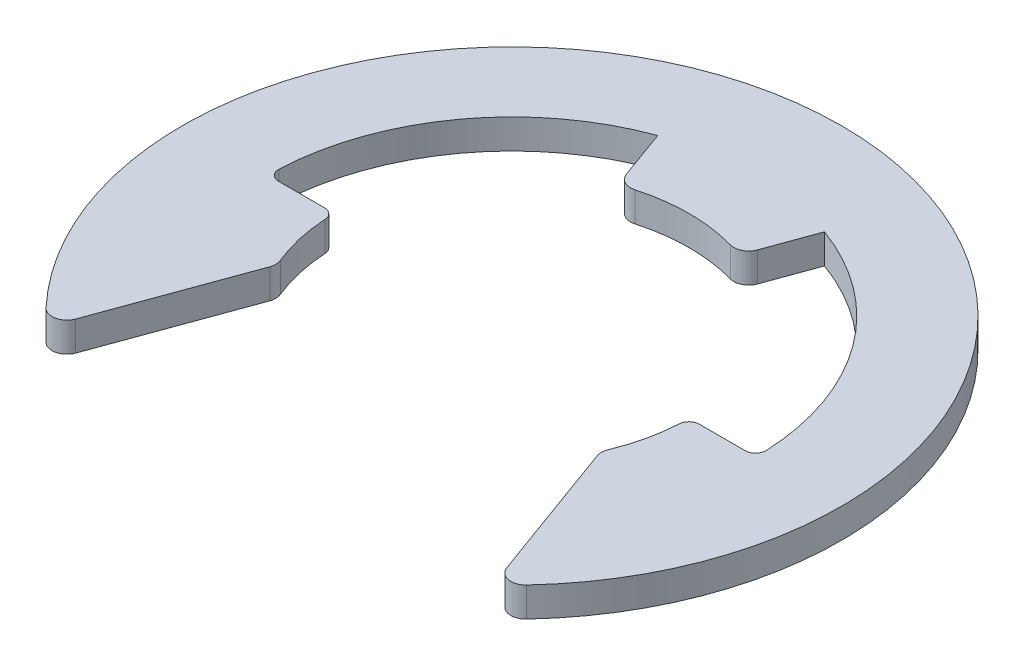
ISO-10303-21;
HEADER;
FILE_DESCRIPTION(('STEP AP214'),'2;1');
FILE_NAME('part.step','',(''),(''),'','','');
FILE_SCHEMA(('AUTOMOTIVE_DESIGN { 1 0 10303 214 1 1 1 1 }'));
ENDSEC;
DATA;
#1=APPLICATION_CONTEXT('core data for automotive mechanical design processes');
#2=APPLICATION_PROTOCOL_DEFINITION('international standard','automotive_design',2000,#1);
#3=PRODUCT_CONTEXT('',#1,'mechanical');
#4=PRODUCT('Part','Part','',(#3));
#5=PRODUCT_RELATED_PRODUCT_CATEGORY('part','',(#4));
#6=PRODUCT_DEFINITION_FORMATION('','',#4);
#7=PRODUCT_DEFINITION_CONTEXT('part definition',#1,'design');
#8=PRODUCT_DEFINITION('design','',#6,#7);
#9=PRODUCT_DEFINITION_SHAPE('','',#8);
#10=(LENGTH_UNIT() NAMED_UNIT(*) SI_UNIT(.MILLI.,.METRE.));
#11=(NAMED_UNIT(*) PLANE_ANGLE_UNIT() SI_UNIT($,.RADIAN.));
#12=(NAMED_UNIT(*) SI_UNIT($,.STERADIAN.) SOLID_ANGLE_UNIT());
#13=UNCERTAINTY_MEASURE_WITH_UNIT(LENGTH_MEASURE(1.E-05),#10,'distance_accuracy_value','');
#14=(GEOMETRIC_REPRESENTATION_CONTEXT(3) GLOBAL_UNCERTAINTY_ASSIGNED_CONTEXT((#13)) GLOBAL_UNIT_ASSIGNED_CONTEXT((#10,
#11,#12)) REPRESENTATION_CONTEXT('',''));
#15=CARTESIAN_POINT('',(0.,0.,0.));
#16=DIRECTION('',(0.,0.,1.));
#17=DIRECTION('',(1.,0.,0.));
#18=AXIS2_PLACEMENT_3D('',#15,#16,#17);
#19=CARTESIAN_POINT('',(0.,1.,0.));
#20=DIRECTION('',(0.,-1.,0.));
#21=DIRECTION('',(0.,0.,-1.));
#22=AXIS2_PLACEMENT_3D('',#19,#20,#21);
#23=CYLINDRICAL_SURFACE('',#22,16.5);
#24=CARTESIAN_POINT('',(0.,1.,0.));
#25=DIRECTION('',(0.,-1.,0.));
#26=DIRECTION('',(0.,0.,1.));
#27=AXIS2_PLACEMENT_3D('',#24,#25,#26);
#28=CIRCLE('',#27,16.5);
#29=CARTESIAN_POINT('',(-16.483798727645,1.,-0.731012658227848));
#30=VERTEX_POINT('',#29);
#31=CARTESIAN_POINT('',(-5.64333236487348,1.,-15.5049282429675));
#32=VERTEX_POINT('',#31);
#33=EDGE_CURVE('E187',#30,#32,#28,.T.);
#34=ORIENTED_EDGE('',*,*,#33,.F.);
#35=DIRECTION('',(0.,-1.,0.));
#36=VECTOR('',#35,1.);
#37=CARTESIAN_POINT('',(-16.483798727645,1.,-0.731012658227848));
#38=LINE('',#37,#36);
#39=CARTESIAN_POINT('',(-16.483798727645,-1.,-0.731012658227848));
#40=VERTEX_POINT('',#39);
#41=EDGE_CURVE('E328',#30,#40,#38,.T.);
#42=ORIENTED_EDGE('',*,*,#41,.T.);
#43=CARTESIAN_POINT('',(0.,-1.,0.));
#44=DIRECTION('',(0.,-1.,0.));
#45=DIRECTION('',(0.,0.,1.));
#46=AXIS2_PLACEMENT_3D('',#43,#44,#45);
#47=CIRCLE('',#46,16.5);
#48=CARTESIAN_POINT('',(-5.64333236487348,-1.,-15.5049282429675));
#49=VERTEX_POINT('',#48);
#50=EDGE_CURVE('E211',#40,#49,#47,.T.);
#51=ORIENTED_EDGE('',*,*,#50,.T.);
#52=DIRECTION('',(0.,-1.,0.));
#53=VECTOR('',#52,1.);
#54=CARTESIAN_POINT('',(-5.64333236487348,1.,-15.5049282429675));
#55=LINE('',#54,#53);
#56=EDGE_CURVE('E204',#32,#49,#55,.T.);
#57=ORIENTED_EDGE('',*,*,#56,.F.);
#58=EDGE_LOOP('',(#34,#42,#51,#57));
#59=FACE_BOUND('',#58,.T.);
#60=ADVANCED_FACE('F39',(#59),#23,.F.);
#61=CARTESIAN_POINT('',(-5.64333236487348,1.,-15.5049282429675));
#62=DIRECTION('',(0.93969262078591,0.,-0.342020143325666));
#63=DIRECTION('',(-0.342020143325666,0.,-0.93969262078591));
#64=AXIS2_PLACEMENT_3D('',#61,#62,#63);
#65=PLANE('',#64);
#66=DIRECTION('',(0.342020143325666,0.,0.93969262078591));
#67=VECTOR('',#66,1.);
#68=CARTESIAN_POINT('',(-5.64333236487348,-1.,-15.5049282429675));
#69=LINE('',#68,#67);
#70=CARTESIAN_POINT('',(-4.43308772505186,-1.,-12.1798084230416));
#71=VERTEX_POINT('',#70);
#72=EDGE_CURVE('E446',#49,#71,#69,.T.);
#73=ORIENTED_EDGE('',*,*,#72,.T.);
#74=DIRECTION('',(0.,-1.,0.));
#75=VECTOR('',#74,1.);
#76=CARTESIAN_POINT('',(-4.43308772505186,1.,-12.1798084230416));
#77=LINE('',#76,#75);
#78=CARTESIAN_POINT('',(-4.43308772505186,1.,-12.1798084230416));
#79=VERTEX_POINT('',#78);
#80=EDGE_CURVE('E206',#71,#79,#77,.F.);
#81=ORIENTED_EDGE('',*,*,#80,.T.);
#82=DIRECTION('',(0.342020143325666,0.,0.93969262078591));
#83=VECTOR('',#82,1.);
#84=CARTESIAN_POINT('',(-5.64333236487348,1.,-15.5049282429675));
#85=LINE('',#84,#83);
#86=EDGE_CURVE('E191',#32,#79,#85,.T.);
#87=ORIENTED_EDGE('',*,*,#86,.F.);
#88=ORIENTED_EDGE('',*,*,#56,.T.);
#89=EDGE_LOOP('',(#73,#81,#87,#88));
#90=FACE_BOUND('',#89,.T.);
#91=ADVANCED_FACE('F203',(#90),#65,.F.);
#92=CARTESIAN_POINT('',(0.,1.,0.));
#93=DIRECTION('',(0.,-1.,0.));
#94=DIRECTION('',(0.,0.,-1.));
#95=AXIS2_PLACEMENT_3D('',#92,#93,#94);
#96=CYLINDRICAL_SURFACE('',#95,12.);
#97=CARTESIAN_POINT('',(0.,-1.,0.));
#98=DIRECTION('',(0.,-1.,0.));
#99=DIRECTION('',(0.,0.,1.));
#100=AXIS2_PLACEMENT_3D('',#97,#98,#99);
#101=CIRCLE('',#100,12.);
#102=CARTESIAN_POINT('',(-3.2246724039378,-1.,-11.558610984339));
#103=VERTEX_POINT('',#102);
#104=CARTESIAN_POINT('',(3.2246724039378,-1.,-11.558610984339));
#105=VERTEX_POINT('',#104);
#106=EDGE_CURVE('E449',#103,#105,#101,.T.);
#107=ORIENTED_EDGE('',*,*,#106,.T.);
#108=DIRECTION('',(0.,-1.,0.));
#109=VECTOR('',#108,1.);
#110=CARTESIAN_POINT('',(3.2246724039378,1.,-11.558610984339));
#111=LINE('',#110,#109);
#112=CARTESIAN_POINT('',(3.2246724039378,1.,-11.558610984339));
#113=VERTEX_POINT('',#112);
#114=EDGE_CURVE('E290',#105,#113,#111,.F.);
#115=ORIENTED_EDGE('',*,*,#114,.T.);
#116=CARTESIAN_POINT('',(0.,1.,0.));
#117=DIRECTION('',(0.,-1.,0.));
#118=DIRECTION('',(0.,0.,1.));
#119=AXIS2_PLACEMENT_3D('',#116,#117,#118);
#120=CIRCLE('',#119,12.);
#121=CARTESIAN_POINT('',(-3.2246724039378,1.,-11.558610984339));
#122=VERTEX_POINT('',#121);
#123=EDGE_CURVE('E208',#122,#113,#120,.T.);
#124=ORIENTED_EDGE('',*,*,#123,.F.);
#125=DIRECTION('',(0.,-1.,0.));
#126=VECTOR('',#125,1.);
#127=CARTESIAN_POINT('',(-3.2246724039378,1.,-11.558610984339));
#128=LINE('',#127,#126);
#129=EDGE_CURVE('E287',#122,#103,#128,.T.);
#130=ORIENTED_EDGE('',*,*,#129,.T.);
#131=EDGE_LOOP('',(#107,#115,#124,#130));
#132=FACE_BOUND('',#131,.T.);
#133=ADVANCED_FACE('F370',(#132),#96,.F.);
#134=CARTESIAN_POINT('',(4.10424171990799,1.,-11.2763114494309));
#135=DIRECTION('',(-0.93969262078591,0.,-0.342020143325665));
#136=DIRECTION('',(-0.342020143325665,0.,0.93969262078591));
#137=AXIS2_PLACEMENT_3D('',#134,#135,#136);
#138=PLANE('',#137);
#139=DIRECTION('',(0.342020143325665,0.,-0.93969262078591));
#140=VECTOR('',#139,1.);
#141=CARTESIAN_POINT('',(4.10424171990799,1.,-11.2763114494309));
#142=LINE('',#141,#140);
#143=CARTESIAN_POINT('',(4.43308772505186,1.,-12.1798084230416));
#144=VERTEX_POINT('',#143);
#145=CARTESIAN_POINT('',(5.64333236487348,1.,-15.5049282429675));
#146=VERTEX_POINT('',#145);
#147=EDGE_CURVE('E423',#144,#146,#142,.T.);
#148=ORIENTED_EDGE('',*,*,#147,.F.);
#149=DIRECTION('',(0.,-1.,0.));
#150=VECTOR('',#149,1.);
#151=CARTESIAN_POINT('',(4.43308772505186,1.,-12.1798084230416));
#152=LINE('',#151,#150);
#153=CARTESIAN_POINT('',(4.43308772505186,-1.,-12.1798084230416));
#154=VERTEX_POINT('',#153);
#155=EDGE_CURVE('E283',#144,#154,#152,.T.);
#156=ORIENTED_EDGE('',*,*,#155,.T.);
#157=DIRECTION('',(0.342020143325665,0.,-0.93969262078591));
#158=VECTOR('',#157,1.);
#159=CARTESIAN_POINT('',(4.10424171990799,-1.,-11.2763114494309));
#160=LINE('',#159,#158);
#161=CARTESIAN_POINT('',(5.64333236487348,-1.,-15.5049282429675));
#162=VERTEX_POINT('',#161);
#163=EDGE_CURVE('E453',#154,#162,#160,.T.);
#164=ORIENTED_EDGE('',*,*,#163,.T.);
#165=DIRECTION('',(0.,-1.,0.));
#166=VECTOR('',#165,1.);
#167=CARTESIAN_POINT('',(5.64333236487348,1.,-15.5049282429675));
#168=LINE('',#167,#166);
#169=EDGE_CURVE('E215',#146,#162,#168,.T.);
#170=ORIENTED_EDGE('',*,*,#169,.F.);
#171=EDGE_LOOP('',(#148,#156,#164,#170));
#172=FACE_BOUND('',#171,.T.);
#173=ADVANCED_FACE('F527',(#172),#138,.F.);
#174=CARTESIAN_POINT('',(0.,1.,0.));
#175=DIRECTION('',(0.,-1.,0.));
#176=DIRECTION('',(0.,0.,-1.));
#177=AXIS2_PLACEMENT_3D('',#174,#175,#176);
#178=CYLINDRICAL_SURFACE('',#177,16.5);
#179=CARTESIAN_POINT('',(0.,-1.,0.));
#180=DIRECTION('',(0.,-1.,0.));
#181=DIRECTION('',(0.,0.,1.));
#182=AXIS2_PLACEMENT_3D('',#179,#180,#181);
#183=CIRCLE('',#182,16.5);
#184=CARTESIAN_POINT('',(16.483798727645,-1.,-0.731012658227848));
#185=VERTEX_POINT('',#184);
#186=EDGE_CURVE('E456',#162,#185,#183,.T.);
#187=ORIENTED_EDGE('',*,*,#186,.T.);
#188=DIRECTION('',(0.,-1.,0.));
#189=VECTOR('',#188,1.);
#190=CARTESIAN_POINT('',(16.483798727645,1.,-0.731012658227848));
#191=LINE('',#190,#189);
#192=CARTESIAN_POINT('',(16.483798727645,1.,-0.731012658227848));
#193=VERTEX_POINT('',#192);
#194=EDGE_CURVE('E309',#185,#193,#191,.F.);
#195=ORIENTED_EDGE('',*,*,#194,.T.);
#196=CARTESIAN_POINT('',(0.,1.,0.));
#197=DIRECTION('',(0.,-1.,0.));
#198=DIRECTION('',(0.,0.,1.));
#199=AXIS2_PLACEMENT_3D('',#196,#197,#198);
#200=CIRCLE('',#199,16.5);
#201=EDGE_CURVE('E410',#146,#193,#200,.T.);
#202=ORIENTED_EDGE('',*,*,#201,.F.);
#203=ORIENTED_EDGE('',*,*,#169,.T.);
#204=EDGE_LOOP('',(#187,#195,#202,#203));
#205=FACE_BOUND('',#204,.T.);
#206=ADVANCED_FACE('F521',(#205),#178,.F.);
#207=CARTESIAN_POINT('',(12.,1.,0.));
#208=DIRECTION('',(0.,0.,1.));
#209=DIRECTION('',(1.,0.,0.));
#210=AXIS2_PLACEMENT_3D('',#207,#208,#209);
#211=PLANE('',#210);
#212=DIRECTION('',(-1.,0.,0.));
#213=VECTOR('',#212,1.);
#214=CARTESIAN_POINT('',(12.,1.,0.));
#215=LINE('',#214,#213);
#216=CARTESIAN_POINT('',(15.784486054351,1.,0.));
#217=VERTEX_POINT('',#216);
#218=CARTESIAN_POINT('',(12.6806939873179,1.,0.));
#219=VERTEX_POINT('',#218);
#220=EDGE_CURVE('E407',#217,#219,#215,.T.);
#221=ORIENTED_EDGE('',*,*,#220,.F.);
#222=DIRECTION('',(0.,1.,0.));
#223=VECTOR('',#222,1.);
#224=CARTESIAN_POINT('',(15.784486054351,-1.,0.));
#225=LINE('',#224,#223);
#226=CARTESIAN_POINT('',(15.784486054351,-1.,0.));
#227=VERTEX_POINT('',#226);
#228=EDGE_CURVE('E305',#217,#227,#225,.F.);
#229=ORIENTED_EDGE('',*,*,#228,.T.);
#230=DIRECTION('',(-1.,0.,0.));
#231=VECTOR('',#230,1.);
#232=CARTESIAN_POINT('',(12.,-1.,0.));
#233=LINE('',#232,#231);
#234=CARTESIAN_POINT('',(12.6806939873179,-1.,0.));
#235=VERTEX_POINT('',#234);
#236=EDGE_CURVE('E460',#227,#235,#233,.T.);
#237=ORIENTED_EDGE('',*,*,#236,.T.);
#238=DIRECTION('',(0.,-1.,0.));
#239=VECTOR('',#238,1.);
#240=CARTESIAN_POINT('',(12.6806939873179,1.,0.));
#241=LINE('',#240,#239);
#242=EDGE_CURVE('E302',#235,#219,#241,.F.);
#243=ORIENTED_EDGE('',*,*,#242,.T.);
#244=EDGE_LOOP('',(#221,#229,#237,#243));
#245=FACE_BOUND('',#244,.T.);
#246=ADVANCED_FACE('F412',(#245),#211,.F.);
#247=CARTESIAN_POINT('',(0.,1.,0.));
#248=DIRECTION('',(0.,-1.,0.));
#249=DIRECTION('',(0.,0.,-1.));
#250=AXIS2_PLACEMENT_3D('',#247,#248,#249);
#251=CYLINDRICAL_SURFACE('',#250,12.);
#252=CARTESIAN_POINT('',(0.,1.,0.));
#253=DIRECTION('',(0.,-1.,0.));
#254=DIRECTION('',(0.,0.,1.));
#255=AXIS2_PLACEMENT_3D('',#252,#253,#254);
#256=CIRCLE('',#255,12.);
#257=CARTESIAN_POINT('',(11.9817580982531,1.,0.661417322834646));
#258=VERTEX_POINT('',#257);
#259=CARTESIAN_POINT('',(11.0912955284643,1.,4.58073831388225));
#260=VERTEX_POINT('',#259);
#261=EDGE_CURVE('E417',#258,#260,#256,.T.);
#262=ORIENTED_EDGE('',*,*,#261,.F.);
#263=DIRECTION('',(0.,-1.,0.));
#264=VECTOR('',#263,1.);
#265=CARTESIAN_POINT('',(11.9817580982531,1.,0.661417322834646));
#266=LINE('',#265,#264);
#267=CARTESIAN_POINT('',(11.9817580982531,-1.,0.661417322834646));
#268=VERTEX_POINT('',#267);
#269=EDGE_CURVE('E312',#258,#268,#266,.T.);
#270=ORIENTED_EDGE('',*,*,#269,.T.);
#271=CARTESIAN_POINT('',(0.,-1.,0.));
#272=DIRECTION('',(0.,-1.,0.));
#273=DIRECTION('',(0.,0.,1.));
#274=AXIS2_PLACEMENT_3D('',#271,#272,#273);
#275=CIRCLE('',#274,12.);
#276=CARTESIAN_POINT('',(11.0912955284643,-1.,4.58073831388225));
#277=VERTEX_POINT('',#276);
#278=EDGE_CURVE('E463',#268,#277,#275,.T.);
#279=ORIENTED_EDGE('',*,*,#278,.T.);
#280=DIRECTION('',(0.,-1.,0.));
#281=VECTOR('',#280,1.);
#282=CARTESIAN_POINT('',(11.0912955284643,1.,4.58073831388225));
#283=LINE('',#282,#281);
#284=EDGE_CURVE('E250',#277,#260,#283,.F.);
#285=ORIENTED_EDGE('',*,*,#284,.T.);
#286=EDGE_LOOP('',(#262,#270,#279,#285));
#287=FACE_BOUND('',#286,.T.);
#288=ADVANCED_FACE('F512',(#287),#251,.F.);
#289=CARTESIAN_POINT('',(10.94,1.,4.93116619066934));
#290=DIRECTION('',(0.939692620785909,0.,-0.342020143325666));
#291=DIRECTION('',(-0.342020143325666,0.,-0.939692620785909));
#292=AXIS2_PLACEMENT_3D('',#289,#290,#291);
#293=PLANE('',#292);
#294=DIRECTION('',(0.342020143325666,0.,0.939692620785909));
#295=VECTOR('',#294,1.);
#296=CARTESIAN_POINT('',(10.94,1.,4.93116619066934));
#297=LINE('',#296,#295);
#298=CARTESIAN_POINT('',(11.0758775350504,1.,5.30448665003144));
#299=VERTEX_POINT('',#298);
#300=CARTESIAN_POINT('',(14.5796591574,1.,14.9310475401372));
#301=VERTEX_POINT('',#300);
#302=EDGE_CURVE('E420',#299,#301,#297,.T.);
#303=ORIENTED_EDGE('',*,*,#302,.F.);
#304=DIRECTION('',(0.,-1.,0.));
#305=VECTOR('',#304,1.);
#306=CARTESIAN_POINT('',(11.0758775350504,1.,5.30448665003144));
#307=LINE('',#306,#305);
#308=CARTESIAN_POINT('',(11.0758775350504,-1.,5.30448665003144));
#309=VERTEX_POINT('',#308);
#310=EDGE_CURVE('E220',#299,#309,#307,.T.);
#311=ORIENTED_EDGE('',*,*,#310,.T.);
#312=DIRECTION('',(0.342020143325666,0.,0.939692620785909));
#313=VECTOR('',#312,1.);
#314=CARTESIAN_POINT('',(10.94,-1.,4.93116619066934));
#315=LINE('',#314,#313);
#316=CARTESIAN_POINT('',(14.5796591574,-1.,14.9310475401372));
#317=VERTEX_POINT('',#316);
#318=EDGE_CURVE('E466',#309,#317,#315,.T.);
#319=ORIENTED_EDGE('',*,*,#318,.T.);
#320=DIRECTION('',(0.,-1.,0.));
#321=VECTOR('',#320,1.);
#322=CARTESIAN_POINT('',(14.5796591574,1.,14.9310475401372));
#323=LINE('',#322,#321);
#324=EDGE_CURVE('E214',#317,#301,#323,.F.);
#325=ORIENTED_EDGE('',*,*,#324,.T.);
#326=EDGE_LOOP('',(#303,#311,#319,#325));
#327=FACE_BOUND('',#326,.T.);
#328=ADVANCED_FACE('F506',(#327),#293,.F.);
#329=CARTESIAN_POINT('',(0.,1.,0.));
#330=DIRECTION('',(0.,-1.,0.));
#331=DIRECTION('',(0.,0.,-1.));
#332=AXIS2_PLACEMENT_3D('',#329,#330,#331);
#333=CYLINDRICAL_SURFACE('',#332,22.3);
#334=CARTESIAN_POINT('',(0.,1.,0.));
#335=DIRECTION('',(0.,1.,0.));
#336=DIRECTION('',(0.,0.,1.));
#337=AXIS2_PLACEMENT_3D('',#334,#335,#336);
#338=CIRCLE('',#337,22.3);
#339=CARTESIAN_POINT('',(16.2479598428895,1.,15.2739582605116));
#340=VERTEX_POINT('',#339);
#341=CARTESIAN_POINT('',(-16.2479598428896,1.,15.2739582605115));
#342=VERTEX_POINT('',#341);
#343=EDGE_CURVE('E430',#340,#342,#338,.T.);
#344=ORIENTED_EDGE('',*,*,#343,.F.);
#345=DIRECTION('',(0.,-1.,0.));
#346=VECTOR('',#345,1.);
#347=CARTESIAN_POINT('',(16.2479598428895,1.,15.2739582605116));
#348=LINE('',#347,#346);
#349=CARTESIAN_POINT('',(16.2479598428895,-1.,15.2739582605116));
#350=VERTEX_POINT('',#349);
#351=EDGE_CURVE('E298',#340,#350,#348,.T.);
#352=ORIENTED_EDGE('',*,*,#351,.T.);
#353=CARTESIAN_POINT('',(0.,-1.,0.));
#354=DIRECTION('',(0.,1.,0.));
#355=DIRECTION('',(0.,0.,1.));
#356=AXIS2_PLACEMENT_3D('',#353,#354,#355);
#357=CIRCLE('',#356,22.3);
#358=CARTESIAN_POINT('',(-16.2479598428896,-1.,15.2739582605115));
#359=VERTEX_POINT('',#358);
#360=EDGE_CURVE('E470',#350,#359,#357,.T.);
#361=ORIENTED_EDGE('',*,*,#360,.T.);
#362=DIRECTION('',(0.,-1.,0.));
#363=VECTOR('',#362,1.);
#364=CARTESIAN_POINT('',(-16.2479598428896,1.,15.2739582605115));
#365=LINE('',#364,#363);
#366=EDGE_CURVE('E295',#359,#342,#365,.F.);
#367=ORIENTED_EDGE('',*,*,#366,.T.);
#368=EDGE_LOOP('',(#344,#352,#361,#367));
#369=FACE_BOUND('',#368,.T.);
#370=ADVANCED_FACE('F499',(#369),#333,.T.);
#371=CARTESIAN_POINT('',(-15.1133793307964,1.,16.3974316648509));
#372=DIRECTION('',(-0.939692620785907,0.,-0.342020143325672));
#373=DIRECTION('',(-0.342020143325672,0.,0.939692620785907));
#374=AXIS2_PLACEMENT_3D('',#371,#372,#373);
#375=PLANE('',#374);
#376=DIRECTION('',(0.342020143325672,0.,-0.939692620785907));
#377=VECTOR('',#376,1.);
#378=CARTESIAN_POINT('',(-15.1133793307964,-1.,16.3974316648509));
#379=LINE('',#378,#377);
#380=CARTESIAN_POINT('',(-14.5796591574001,-1.,14.9310475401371));
#381=VERTEX_POINT('',#380);
#382=CARTESIAN_POINT('',(-11.0758775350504,-1.,5.30448665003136));
#383=VERTEX_POINT('',#382);
#384=EDGE_CURVE('E474',#381,#383,#379,.T.);
#385=ORIENTED_EDGE('',*,*,#384,.T.);
#386=DIRECTION('',(0.,-1.,0.));
#387=VECTOR('',#386,1.);
#388=CARTESIAN_POINT('',(-11.0758775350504,1.,5.30448665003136));
#389=LINE('',#388,#387);
#390=CARTESIAN_POINT('',(-11.0758775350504,1.,5.30448665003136));
#391=VERTEX_POINT('',#390);
#392=EDGE_CURVE('E280',#383,#391,#389,.F.);
#393=ORIENTED_EDGE('',*,*,#392,.T.);
#394=DIRECTION('',(0.342020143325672,0.,-0.939692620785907));
#395=VECTOR('',#394,1.);
#396=CARTESIAN_POINT('',(-15.1133793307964,1.,16.3974316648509));
#397=LINE('',#396,#395);
#398=CARTESIAN_POINT('',(-14.5796591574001,1.,14.9310475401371));
#399=VERTEX_POINT('',#398);
#400=EDGE_CURVE('E434',#399,#391,#397,.T.);
#401=ORIENTED_EDGE('',*,*,#400,.F.);
#402=DIRECTION('',(0.,-1.,0.));
#403=VECTOR('',#402,1.);
#404=CARTESIAN_POINT('',(-14.5796591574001,1.,14.9310475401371));
#405=LINE('',#404,#403);
#406=EDGE_CURVE('E276',#399,#381,#405,.T.);
#407=ORIENTED_EDGE('',*,*,#406,.T.);
#408=EDGE_LOOP('',(#385,#393,#401,#407));
#409=FACE_BOUND('',#408,.T.);
#410=ADVANCED_FACE('F491',(#409),#375,.F.);
#411=CARTESIAN_POINT('',(0.,1.,0.));
#412=DIRECTION('',(0.,-1.,0.));
#413=DIRECTION('',(0.,0.,-1.));
#414=AXIS2_PLACEMENT_3D('',#411,#412,#413);
#415=CYLINDRICAL_SURFACE('',#414,12.);
#416=CARTESIAN_POINT('',(0.,-1.,0.));
#417=DIRECTION('',(0.,-1.,0.));
#418=DIRECTION('',(0.,0.,1.));
#419=AXIS2_PLACEMENT_3D('',#416,#417,#418);
#420=CIRCLE('',#419,12.);
#421=CARTESIAN_POINT('',(-11.0912955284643,-1.,4.58073831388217));
#422=VERTEX_POINT('',#421);
#423=CARTESIAN_POINT('',(-11.9817580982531,-1.,0.661417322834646));
#424=VERTEX_POINT('',#423);
#425=EDGE_CURVE('E353',#422,#424,#420,.T.);
#426=ORIENTED_EDGE('',*,*,#425,.T.);
#427=DIRECTION('',(0.,-1.,0.));
#428=VECTOR('',#427,1.);
#429=CARTESIAN_POINT('',(-11.9817580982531,1.,0.661417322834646));
#430=LINE('',#429,#428);
#431=CARTESIAN_POINT('',(-11.9817580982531,1.,0.661417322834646));
#432=VERTEX_POINT('',#431);
#433=EDGE_CURVE('E337',#424,#432,#430,.F.);
#434=ORIENTED_EDGE('',*,*,#433,.T.);
#435=CARTESIAN_POINT('',(0.,1.,0.));
#436=DIRECTION('',(0.,-1.,0.));
#437=DIRECTION('',(0.,0.,1.));
#438=AXIS2_PLACEMENT_3D('',#435,#436,#437);
#439=CIRCLE('',#438,12.);
#440=CARTESIAN_POINT('',(-11.0912955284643,1.,4.58073831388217));
#441=VERTEX_POINT('',#440);
#442=EDGE_CURVE('E438',#441,#432,#439,.T.);
#443=ORIENTED_EDGE('',*,*,#442,.F.);
#444=DIRECTION('',(0.,-1.,0.));
#445=VECTOR('',#444,1.);
#446=CARTESIAN_POINT('',(-11.0912955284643,1.,4.58073831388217));
#447=LINE('',#446,#445);
#448=EDGE_CURVE('E272',#441,#422,#447,.T.);
#449=ORIENTED_EDGE('',*,*,#448,.T.);
#450=EDGE_LOOP('',(#426,#434,#443,#449));
#451=FACE_BOUND('',#450,.T.);
#452=ADVANCED_FACE('F483',(#451),#415,.F.);
#453=CARTESIAN_POINT('',(-12.,1.,0.));
#454=DIRECTION('',(0.,0.,1.));
#455=DIRECTION('',(1.,0.,0.));
#456=AXIS2_PLACEMENT_3D('',#453,#454,#455);
#457=PLANE('',#456);
#458=DIRECTION('',(-1.,0.,0.));
#459=VECTOR('',#458,1.);
#460=CARTESIAN_POINT('',(-12.,-1.,0.));
#461=LINE('',#460,#459);
#462=CARTESIAN_POINT('',(-12.6806939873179,-1.,0.));
#463=VERTEX_POINT('',#462);
#464=CARTESIAN_POINT('',(-15.784486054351,-1.,0.));
#465=VERTEX_POINT('',#464);
#466=EDGE_CURVE('E198',#463,#465,#461,.T.);
#467=ORIENTED_EDGE('',*,*,#466,.T.);
#468=DIRECTION('',(0.,1.,0.));
#469=VECTOR('',#468,1.);
#470=CARTESIAN_POINT('',(-15.784486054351,1.,0.));
#471=LINE('',#470,#469);
#472=CARTESIAN_POINT('',(-15.784486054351,1.,0.));
#473=VERTEX_POINT('',#472);
#474=EDGE_CURVE('E61',#465,#473,#471,.T.);
#475=ORIENTED_EDGE('',*,*,#474,.T.);
#476=DIRECTION('',(-1.,0.,0.));
#477=VECTOR('',#476,1.);
#478=CARTESIAN_POINT('',(-12.,1.,0.));
#479=LINE('',#478,#477);
#480=CARTESIAN_POINT('',(-12.6806939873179,1.,0.));
#481=VERTEX_POINT('',#480);
#482=EDGE_CURVE('E224',#481,#473,#479,.T.);
#483=ORIENTED_EDGE('',*,*,#482,.F.);
#484=DIRECTION('',(0.,-1.,0.));
#485=VECTOR('',#484,1.);
#486=CARTESIAN_POINT('',(-12.6806939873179,1.,0.));
#487=LINE('',#486,#485);
#488=EDGE_CURVE('E331',#481,#463,#487,.T.);
#489=ORIENTED_EDGE('',*,*,#488,.T.);
#490=EDGE_LOOP('',(#467,#475,#483,#489));
#491=FACE_BOUND('',#490,.T.);
#492=ADVANCED_FACE('F350',(#491),#457,.F.);
#493=CARTESIAN_POINT('',(0.,1.,0.));
#494=DIRECTION('',(0.,1.,0.));
#495=DIRECTION('',(0.,0.,1.));
#496=AXIS2_PLACEMENT_3D('',#493,#494,#495);
#497=PLANE('',#496);
#498=ORIENTED_EDGE('',*,*,#220,.T.);
#499=CARTESIAN_POINT('',(12.6806939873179,1.,0.7));
#500=DIRECTION('',(0.,1.,0.));
#501=DIRECTION('',(0.,0.,1.));
#502=AXIS2_PLACEMENT_3D('',#499,#500,#501);
#503=CIRCLE('',#502,0.7);
#504=EDGE_CURVE('E325',#219,#258,#503,.T.);
#505=ORIENTED_EDGE('',*,*,#504,.T.);
#506=ORIENTED_EDGE('',*,*,#261,.T.);
#507=CARTESIAN_POINT('',(12.0155701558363,1.,4.96246650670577));
#508=DIRECTION('',(0.,1.,0.));
#509=DIRECTION('',(0.,0.,1.));
#510=AXIS2_PLACEMENT_3D('',#507,#508,#509);
#511=CIRCLE('',#510,1.);
#512=EDGE_CURVE('E269',#260,#299,#511,.T.);
#513=ORIENTED_EDGE('',*,*,#512,.T.);
#514=ORIENTED_EDGE('',*,*,#302,.T.);
#515=CARTESIAN_POINT('',(15.5193517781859,1.,14.5890273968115));
#516=DIRECTION('',(0.,1.,0.));
#517=DIRECTION('',(0.,0.,1.));
#518=AXIS2_PLACEMENT_3D('',#515,#516,#517);
#519=CIRCLE('',#518,1.);
#520=EDGE_CURVE('E257',#301,#340,#519,.T.);
#521=ORIENTED_EDGE('',*,*,#520,.T.);
#522=ORIENTED_EDGE('',*,*,#343,.T.);
#523=CARTESIAN_POINT('',(-15.519351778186,1.,14.5890273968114));
#524=DIRECTION('',(0.,1.,0.));
#525=DIRECTION('',(0.,0.,1.));
#526=AXIS2_PLACEMENT_3D('',#523,#524,#525);
#527=CIRCLE('',#526,1.);
#528=EDGE_CURVE('E254',#342,#399,#527,.T.);
#529=ORIENTED_EDGE('',*,*,#528,.T.);
#530=ORIENTED_EDGE('',*,*,#400,.T.);
#531=CARTESIAN_POINT('',(-12.0155701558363,1.,4.96246650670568));
#532=DIRECTION('',(0.,1.,0.));
#533=DIRECTION('',(0.,0.,1.));
#534=AXIS2_PLACEMENT_3D('',#531,#532,#533);
#535=CIRCLE('',#534,1.);
#536=EDGE_CURVE('E266',#391,#441,#535,.T.);
#537=ORIENTED_EDGE('',*,*,#536,.T.);
#538=ORIENTED_EDGE('',*,*,#442,.T.);
#539=CARTESIAN_POINT('',(-12.6806939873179,1.,0.7));
#540=DIRECTION('',(0.,1.,0.));
#541=DIRECTION('',(0.,0.,1.));
#542=AXIS2_PLACEMENT_3D('',#539,#540,#541);
#543=CIRCLE('',#542,0.7);
#544=EDGE_CURVE('E322',#432,#481,#543,.T.);
#545=ORIENTED_EDGE('',*,*,#544,.T.);
#546=ORIENTED_EDGE('',*,*,#482,.T.);
#547=CARTESIAN_POINT('',(-15.784486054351,1.,-0.7));
#548=DIRECTION('',(0.,1.,0.));
#549=DIRECTION('',(0.,0.,1.));
#550=AXIS2_PLACEMENT_3D('',#547,#548,#549);
#551=CIRCLE('',#550,0.7);
#552=EDGE_CURVE('E11',#473,#30,#551,.F.);
#553=ORIENTED_EDGE('',*,*,#552,.T.);
#554=ORIENTED_EDGE('',*,*,#33,.T.);
#555=ORIENTED_EDGE('',*,*,#86,.T.);
#556=CARTESIAN_POINT('',(-3.49339510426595,1.,-12.5218285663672));
#557=DIRECTION('',(0.,1.,0.));
#558=DIRECTION('',(0.,0.,1.));
#559=AXIS2_PLACEMENT_3D('',#556,#557,#558);
#560=CIRCLE('',#559,1.);
#561=EDGE_CURVE('E260',#79,#122,#560,.T.);
#562=ORIENTED_EDGE('',*,*,#561,.T.);
#563=ORIENTED_EDGE('',*,*,#123,.T.);
#564=CARTESIAN_POINT('',(3.49339510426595,1.,-12.5218285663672));
#565=DIRECTION('',(0.,1.,0.));
#566=DIRECTION('',(0.,0.,1.));
#567=AXIS2_PLACEMENT_3D('',#564,#565,#566);
#568=CIRCLE('',#567,1.);
#569=EDGE_CURVE('E263',#113,#144,#568,.T.);
#570=ORIENTED_EDGE('',*,*,#569,.T.);
#571=ORIENTED_EDGE('',*,*,#147,.T.);
#572=ORIENTED_EDGE('',*,*,#201,.T.);
#573=CARTESIAN_POINT('',(15.784486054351,1.,-0.7));
#574=DIRECTION('',(0.,1.,0.));
#575=DIRECTION('',(0.,0.,1.));
#576=AXIS2_PLACEMENT_3D('',#573,#574,#575);
#577=CIRCLE('',#576,0.7);
#578=EDGE_CURVE('E343',#193,#217,#577,.F.);
#579=ORIENTED_EDGE('',*,*,#578,.T.);
#580=EDGE_LOOP('',(#498,#505,#506,#513,#514,#521,#522,#529,#530,#537,#538,#545,#546,#553,#554,
#555,#562,#563,#570,#571,#572,#579));
#581=FACE_BOUND('',#580,.T.);
#582=ADVANCED_FACE('F190',(#581),#497,.T.);
#583=CARTESIAN_POINT('',(0.,-1.,0.));
#584=DIRECTION('',(0.,1.,0.));
#585=DIRECTION('',(0.,0.,1.));
#586=AXIS2_PLACEMENT_3D('',#583,#584,#585);
#587=PLANE('',#586);
#588=ORIENTED_EDGE('',*,*,#278,.F.);
#589=CARTESIAN_POINT('',(12.6806939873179,-1.,0.7));
#590=DIRECTION('',(0.,1.,0.));
#591=DIRECTION('',(0.,0.,1.));
#592=AXIS2_PLACEMENT_3D('',#589,#590,#591);
#593=CIRCLE('',#592,0.7);
#594=EDGE_CURVE('E319',#268,#235,#593,.F.);
#595=ORIENTED_EDGE('',*,*,#594,.T.);
#596=ORIENTED_EDGE('',*,*,#236,.F.);
#597=CARTESIAN_POINT('',(15.784486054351,-1.,-0.7));
#598=DIRECTION('',(0.,1.,0.));
#599=DIRECTION('',(0.,0.,1.));
#600=AXIS2_PLACEMENT_3D('',#597,#598,#599);
#601=CIRCLE('',#600,0.7);
#602=EDGE_CURVE('E340',#227,#185,#601,.T.);
#603=ORIENTED_EDGE('',*,*,#602,.T.);
#604=ORIENTED_EDGE('',*,*,#186,.F.);
#605=ORIENTED_EDGE('',*,*,#163,.F.);
#606=CARTESIAN_POINT('',(3.49339510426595,-1.,-12.5218285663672));
#607=DIRECTION('',(0.,1.,0.));
#608=DIRECTION('',(0.,0.,1.));
#609=AXIS2_PLACEMENT_3D('',#606,#607,#608);
#610=CIRCLE('',#609,1.);
#611=EDGE_CURVE('E240',#154,#105,#610,.F.);
#612=ORIENTED_EDGE('',*,*,#611,.T.);
#613=ORIENTED_EDGE('',*,*,#106,.F.);
#614=CARTESIAN_POINT('',(-3.49339510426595,-1.,-12.5218285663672));
#615=DIRECTION('',(0.,1.,0.));
#616=DIRECTION('',(0.,0.,1.));
#617=AXIS2_PLACEMENT_3D('',#614,#615,#616);
#618=CIRCLE('',#617,1.);
#619=EDGE_CURVE('E237',#103,#71,#618,.F.);
#620=ORIENTED_EDGE('',*,*,#619,.T.);
#621=ORIENTED_EDGE('',*,*,#72,.F.);
#622=ORIENTED_EDGE('',*,*,#50,.F.);
#623=CARTESIAN_POINT('',(-15.784486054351,-1.,-0.7));
#624=DIRECTION('',(0.,1.,0.));
#625=DIRECTION('',(0.,0.,1.));
#626=AXIS2_PLACEMENT_3D('',#623,#624,#625);
#627=CIRCLE('',#626,0.7);
#628=EDGE_CURVE('E48',#40,#465,#627,.T.);
#629=ORIENTED_EDGE('',*,*,#628,.T.);
#630=ORIENTED_EDGE('',*,*,#466,.F.);
#631=CARTESIAN_POINT('',(-12.6806939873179,-1.,0.7));
#632=DIRECTION('',(0.,1.,0.));
#633=DIRECTION('',(0.,0.,1.));
#634=AXIS2_PLACEMENT_3D('',#631,#632,#633);
#635=CIRCLE('',#634,0.7);
#636=EDGE_CURVE('E316',#463,#424,#635,.F.);
#637=ORIENTED_EDGE('',*,*,#636,.T.);
#638=ORIENTED_EDGE('',*,*,#425,.F.);
#639=CARTESIAN_POINT('',(-12.0155701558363,-1.,4.96246650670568));
#640=DIRECTION('',(0.,1.,0.));
#641=DIRECTION('',(0.,0.,1.));
#642=AXIS2_PLACEMENT_3D('',#639,#640,#641);
#643=CIRCLE('',#642,1.);
#644=EDGE_CURVE('E243',#422,#383,#643,.F.);
#645=ORIENTED_EDGE('',*,*,#644,.T.);
#646=ORIENTED_EDGE('',*,*,#384,.F.);
#647=CARTESIAN_POINT('',(-15.519351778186,-1.,14.5890273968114));
#648=DIRECTION('',(0.,1.,0.));
#649=DIRECTION('',(0.,0.,1.));
#650=AXIS2_PLACEMENT_3D('',#647,#648,#649);
#651=CIRCLE('',#650,1.);
#652=EDGE_CURVE('E231',#381,#359,#651,.F.);
#653=ORIENTED_EDGE('',*,*,#652,.T.);
#654=ORIENTED_EDGE('',*,*,#360,.F.);
#655=CARTESIAN_POINT('',(15.5193517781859,-1.,14.5890273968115));
#656=DIRECTION('',(0.,1.,0.));
#657=DIRECTION('',(0.,0.,1.));
#658=AXIS2_PLACEMENT_3D('',#655,#656,#657);
#659=CIRCLE('',#658,1.);
#660=EDGE_CURVE('E234',#350,#317,#659,.F.);
#661=ORIENTED_EDGE('',*,*,#660,.T.);
#662=ORIENTED_EDGE('',*,*,#318,.F.);
#663=CARTESIAN_POINT('',(12.0155701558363,-1.,4.96246650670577));
#664=DIRECTION('',(0.,1.,0.));
#665=DIRECTION('',(0.,0.,1.));
#666=AXIS2_PLACEMENT_3D('',#663,#664,#665);
#667=CIRCLE('',#666,1.);
#668=EDGE_CURVE('E246',#309,#277,#667,.F.);
#669=ORIENTED_EDGE('',*,*,#668,.T.);
#670=EDGE_LOOP('',(#588,#595,#596,#603,#604,#605,#612,#613,#620,#621,#622,#629,#630,#637,#638,
#645,#646,#653,#654,#661,#662,#669));
#671=FACE_BOUND('',#670,.T.);
#672=ADVANCED_FACE('F348',(#671),#587,.F.);
#673=CARTESIAN_POINT('',(12.0155701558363,1.,4.96246650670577));
#674=DIRECTION('',(0.,-1.,0.));
#675=DIRECTION('',(0.,0.,-1.));
#676=AXIS2_PLACEMENT_3D('',#673,#674,#675);
#677=CYLINDRICAL_SURFACE('',#676,1.);
#678=ORIENTED_EDGE('',*,*,#512,.F.);
#679=ORIENTED_EDGE('',*,*,#284,.F.);
#680=ORIENTED_EDGE('',*,*,#668,.F.);
#681=ORIENTED_EDGE('',*,*,#310,.F.);
#682=EDGE_LOOP('',(#678,#679,#680,#681));
#683=FACE_BOUND('',#682,.T.);
#684=ADVANCED_FACE('F374',(#683),#677,.T.);
#685=CARTESIAN_POINT('',(-12.0155701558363,1.,4.96246650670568));
#686=DIRECTION('',(0.,-1.,0.));
#687=DIRECTION('',(0.,0.,-1.));
#688=AXIS2_PLACEMENT_3D('',#685,#686,#687);
#689=CYLINDRICAL_SURFACE('',#688,1.);
#690=ORIENTED_EDGE('',*,*,#536,.F.);
#691=ORIENTED_EDGE('',*,*,#392,.F.);
#692=ORIENTED_EDGE('',*,*,#644,.F.);
#693=ORIENTED_EDGE('',*,*,#448,.F.);
#694=EDGE_LOOP('',(#690,#691,#692,#693));
#695=FACE_BOUND('',#694,.T.);
#696=ADVANCED_FACE('F377',(#695),#689,.T.);
#697=CARTESIAN_POINT('',(3.49339510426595,1.,-12.5218285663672));
#698=DIRECTION('',(0.,-1.,0.));
#699=DIRECTION('',(0.,0.,-1.));
#700=AXIS2_PLACEMENT_3D('',#697,#698,#699);
#701=CYLINDRICAL_SURFACE('',#700,1.);
#702=ORIENTED_EDGE('',*,*,#569,.F.);
#703=ORIENTED_EDGE('',*,*,#114,.F.);
#704=ORIENTED_EDGE('',*,*,#611,.F.);
#705=ORIENTED_EDGE('',*,*,#155,.F.);
#706=EDGE_LOOP('',(#702,#703,#704,#705));
#707=FACE_BOUND('',#706,.T.);
#708=ADVANCED_FACE('F381',(#707),#701,.T.);
#709=CARTESIAN_POINT('',(-3.49339510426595,1.,-12.5218285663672));
#710=DIRECTION('',(0.,-1.,0.));
#711=DIRECTION('',(0.,0.,-1.));
#712=AXIS2_PLACEMENT_3D('',#709,#710,#711);
#713=CYLINDRICAL_SURFACE('',#712,1.);
#714=ORIENTED_EDGE('',*,*,#561,.F.);
#715=ORIENTED_EDGE('',*,*,#80,.F.);
#716=ORIENTED_EDGE('',*,*,#619,.F.);
#717=ORIENTED_EDGE('',*,*,#129,.F.);
#718=EDGE_LOOP('',(#714,#715,#716,#717));
#719=FACE_BOUND('',#718,.T.);
#720=ADVANCED_FACE('F385',(#719),#713,.T.);
#721=CARTESIAN_POINT('',(15.5193517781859,1.,14.5890273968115));
#722=DIRECTION('',(0.,-1.,0.));
#723=DIRECTION('',(0.,0.,-1.));
#724=AXIS2_PLACEMENT_3D('',#721,#722,#723);
#725=CYLINDRICAL_SURFACE('',#724,1.);
#726=ORIENTED_EDGE('',*,*,#520,.F.);
#727=ORIENTED_EDGE('',*,*,#324,.F.);
#728=ORIENTED_EDGE('',*,*,#660,.F.);
#729=ORIENTED_EDGE('',*,*,#351,.F.);
#730=EDGE_LOOP('',(#726,#727,#728,#729));
#731=FACE_BOUND('',#730,.T.);
#732=ADVANCED_FACE('F389',(#731),#725,.T.);
#733=CARTESIAN_POINT('',(-15.519351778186,1.,14.5890273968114));
#734=DIRECTION('',(0.,-1.,0.));
#735=DIRECTION('',(0.,0.,-1.));
#736=AXIS2_PLACEMENT_3D('',#733,#734,#735);
#737=CYLINDRICAL_SURFACE('',#736,1.);
#738=ORIENTED_EDGE('',*,*,#528,.F.);
#739=ORIENTED_EDGE('',*,*,#366,.F.);
#740=ORIENTED_EDGE('',*,*,#652,.F.);
#741=ORIENTED_EDGE('',*,*,#406,.F.);
#742=EDGE_LOOP('',(#738,#739,#740,#741));
#743=FACE_BOUND('',#742,.T.);
#744=ADVANCED_FACE('F393',(#743),#737,.T.);
#745=CARTESIAN_POINT('',(15.784486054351,1.,-0.7));
#746=DIRECTION('',(0.,-1.,0.));
#747=DIRECTION('',(0.,0.,-1.));
#748=AXIS2_PLACEMENT_3D('',#745,#746,#747);
#749=CYLINDRICAL_SURFACE('',#748,0.7);
#750=ORIENTED_EDGE('',*,*,#578,.F.);
#751=ORIENTED_EDGE('',*,*,#194,.F.);
#752=ORIENTED_EDGE('',*,*,#602,.F.);
#753=ORIENTED_EDGE('',*,*,#228,.F.);
#754=EDGE_LOOP('',(#750,#751,#752,#753));
#755=FACE_BOUND('',#754,.T.);
#756=ADVANCED_FACE('F362',(#755),#749,.F.);
#757=CARTESIAN_POINT('',(12.6806939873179,1.,0.7));
#758=DIRECTION('',(0.,-1.,0.));
#759=DIRECTION('',(0.,0.,-1.));
#760=AXIS2_PLACEMENT_3D('',#757,#758,#759);
#761=CYLINDRICAL_SURFACE('',#760,0.7);
#762=ORIENTED_EDGE('',*,*,#504,.F.);
#763=ORIENTED_EDGE('',*,*,#242,.F.);
#764=ORIENTED_EDGE('',*,*,#594,.F.);
#765=ORIENTED_EDGE('',*,*,#269,.F.);
#766=EDGE_LOOP('',(#762,#763,#764,#765));
#767=FACE_BOUND('',#766,.T.);
#768=ADVANCED_FACE('F356',(#767),#761,.T.);
#769=CARTESIAN_POINT('',(-15.784486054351,1.,-0.7));
#770=DIRECTION('',(0.,-1.,0.));
#771=DIRECTION('',(0.,0.,-1.));
#772=AXIS2_PLACEMENT_3D('',#769,#770,#771);
#773=CYLINDRICAL_SURFACE('',#772,0.7);
#774=ORIENTED_EDGE('',*,*,#552,.F.);
#775=ORIENTED_EDGE('',*,*,#474,.F.);
#776=ORIENTED_EDGE('',*,*,#628,.F.);
#777=ORIENTED_EDGE('',*,*,#41,.F.);
#778=EDGE_LOOP('',(#774,#775,#776,#777));
#779=FACE_BOUND('',#778,.T.);
#780=ADVANCED_FACE('F354',(#779),#773,.F.);
#781=CARTESIAN_POINT('',(-12.6806939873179,1.,0.7));
#782=DIRECTION('',(0.,-1.,0.));
#783=DIRECTION('',(0.,0.,-1.));
#784=AXIS2_PLACEMENT_3D('',#781,#782,#783);
#785=CYLINDRICAL_SURFACE('',#784,0.7);
#786=ORIENTED_EDGE('',*,*,#544,.F.);
#787=ORIENTED_EDGE('',*,*,#433,.F.);
#788=ORIENTED_EDGE('',*,*,#636,.F.);
#789=ORIENTED_EDGE('',*,*,#488,.F.);
#790=EDGE_LOOP('',(#786,#787,#788,#789));
#791=FACE_BOUND('',#790,.T.);
#792=ADVANCED_FACE('F41',(#791),#785,.T.);
#793=CLOSED_SHELL('',(#60,#91,#133,#173,#206,#246,#288,#328,#370,#410,#452,#492,#582,#672,#684,
#696,#708,#720,#732,#744,#756,#768,#780,#792));
#794=MANIFOLD_SOLID_BREP('B2',#793);
#795=ADVANCED_BREP_SHAPE_REPRESENTATION('',(#18,#794),#14);
#796=SHAPE_DEFINITION_REPRESENTATION(#9,#795);
ENDSEC;
END-ISO-10303-21;
